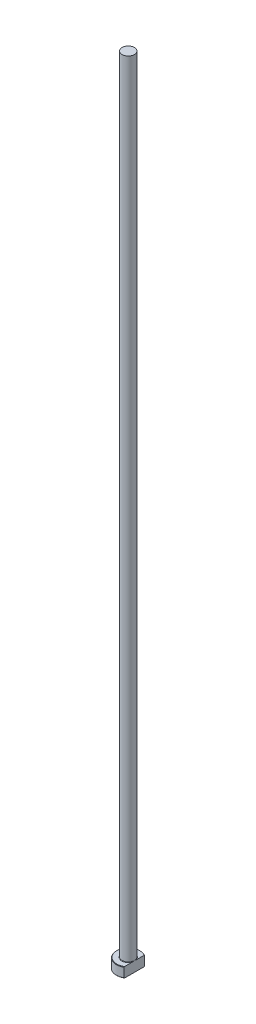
from build123d import *
from build123d.topology import SkipClean

# Parameters (mm, degrees)
CHAMFER1_SIZE = 0.2
FILLET1_R     = 0.2
KEY_DEPTH     = 401.089989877


with BuildPart() as part:
    # Sketch1 → Revolve1 (revolve)
    with BuildSketch(Plane.XY, mode=Mode.PRIVATE) as revolve1_sk:
        Polygon((0, 0), (-6, 0), (-6, 5), (-3.1, 5), (-3.1, 400), (0, 400), align=None)
    revolve(revolve1_sk.sketch.rotate(Axis((0, 259.958771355, 0), (0, -1, 0)), 270), axis=Axis((0, 259.958771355, 0), (0, -1, 0)))

    # Chamfer1
    chamfer1_edges = [part.edges().sort_by_distance(p)[0] for p in [
        (0, 5, -6),
        (0, 0, -6),
    ]]
    chamfer(chamfer1_edges, length=CHAMFER1_SIZE)

    # Fillet1
    fillet1_edges = [part.edges().sort_by_distance(p)[0] for p in [
        (0, 5, -3.1),
    ]]
    fillet(fillet1_edges, radius=FILLET1_R)

    # Sketch2 → KEY (cut, through all)
    with SkipClean():  # the faces are left unmerged after this step: merging them gives an invalid solid
        with BuildSketch(Plane(origin=(0, 0, 0), x_dir=(1, 0, 0), z_dir=(0, 1, 0))):
            with BuildLine():
                Line((3.1, 5.137119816), (3.1, -5.137119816))
                ThreePointArc((3.1, -5.137119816), (6, 0), (3.1, 5.137119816))
            make_face()
        extrude(amount=KEY_DEPTH, mode=Mode.SUBTRACT)


solid = part.part
